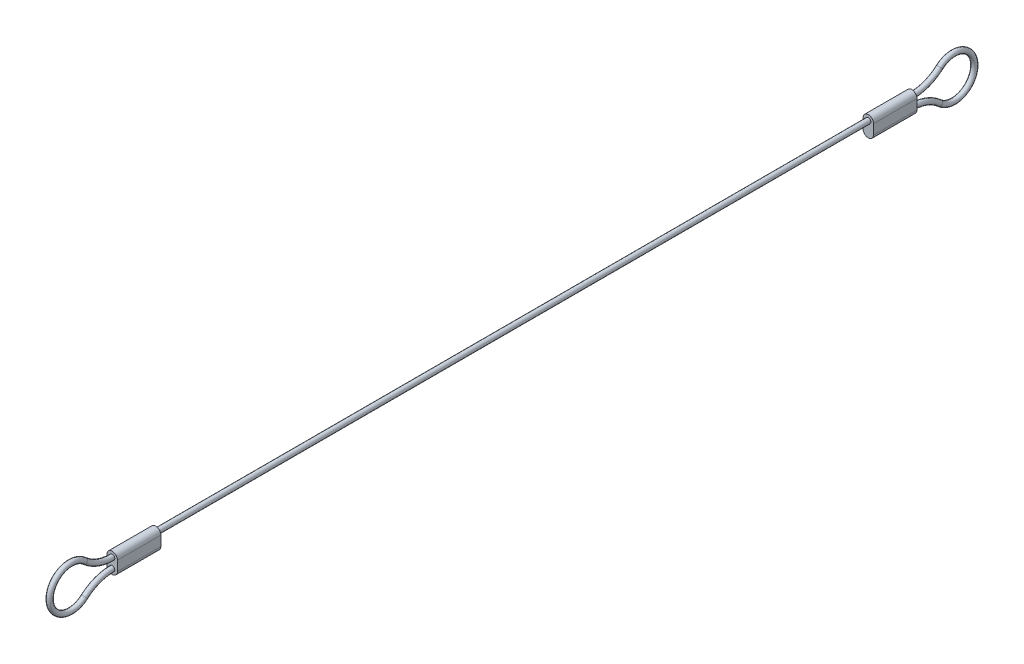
ISO-10303-21;
HEADER;
FILE_DESCRIPTION(('STEP AP214'),'2;1');
FILE_NAME('part.step','',(''),(''),'','','');
FILE_SCHEMA(('AUTOMOTIVE_DESIGN { 1 0 10303 214 1 1 1 1 }'));
ENDSEC;
DATA;
#1=APPLICATION_CONTEXT('core data for automotive mechanical design processes');
#2=APPLICATION_PROTOCOL_DEFINITION('international standard','automotive_design',2000,#1);
#3=PRODUCT_CONTEXT('',#1,'mechanical');
#4=PRODUCT('Part','Part','',(#3));
#5=PRODUCT_RELATED_PRODUCT_CATEGORY('part','',(#4));
#6=PRODUCT_DEFINITION_FORMATION('','',#4);
#7=PRODUCT_DEFINITION_CONTEXT('part definition',#1,'design');
#8=PRODUCT_DEFINITION('design','',#6,#7);
#9=PRODUCT_DEFINITION_SHAPE('','',#8);
#10=(LENGTH_UNIT() NAMED_UNIT(*) SI_UNIT(.MILLI.,.METRE.));
#11=(NAMED_UNIT(*) PLANE_ANGLE_UNIT() SI_UNIT($,.RADIAN.));
#12=(NAMED_UNIT(*) SI_UNIT($,.STERADIAN.) SOLID_ANGLE_UNIT());
#13=UNCERTAINTY_MEASURE_WITH_UNIT(LENGTH_MEASURE(1.E-05),#10,'distance_accuracy_value','');
#14=(GEOMETRIC_REPRESENTATION_CONTEXT(3) GLOBAL_UNCERTAINTY_ASSIGNED_CONTEXT((#13)) GLOBAL_UNIT_ASSIGNED_CONTEXT((#10,
#11,#12)) REPRESENTATION_CONTEXT('',''));
#15=CARTESIAN_POINT('',(0.,0.,0.));
#16=DIRECTION('',(0.,0.,1.));
#17=DIRECTION('',(1.,0.,0.));
#18=AXIS2_PLACEMENT_3D('',#15,#16,#17);
#19=CARTESIAN_POINT('',(0.,0.,-92.));
#20=DIRECTION('',(0.,0.,1.));
#21=DIRECTION('',(1.,0.,0.));
#22=AXIS2_PLACEMENT_3D('',#19,#20,#21);
#23=CYLINDRICAL_SURFACE('',#22,0.595);
#24=CARTESIAN_POINT('',(0.,0.,-82.));
#25=DIRECTION('',(0.,0.,1.));
#26=DIRECTION('',(0.,-1.,0.));
#27=AXIS2_PLACEMENT_3D('',#24,#25,#26);
#28=CIRCLE('',#27,0.595);
#29=CARTESIAN_POINT('',(0.,-0.595,-82.));
#30=VERTEX_POINT('',#29);
#31=EDGE_CURVE('E11',#30,#30,#28,.F.);
#32=ORIENTED_EDGE('',*,*,#31,.F.);
#33=EDGE_LOOP('',(#32));
#34=FACE_BOUND('',#33,.T.);
#35=CARTESIAN_POINT('',(0.,0.,82.));
#36=DIRECTION('',(0.,0.,-1.));
#37=DIRECTION('',(0.,1.,0.));
#38=AXIS2_PLACEMENT_3D('',#35,#36,#37);
#39=CIRCLE('',#38,0.595);
#40=CARTESIAN_POINT('',(0.,0.595,82.));
#41=VERTEX_POINT('',#40);
#42=EDGE_CURVE('E51',#41,#41,#39,.F.);
#43=ORIENTED_EDGE('',*,*,#42,.F.);
#44=EDGE_LOOP('',(#43));
#45=FACE_BOUND('',#44,.T.);
#46=ADVANCED_FACE('F41',(#34,#45),#23,.T.);
#47=CARTESIAN_POINT('',(0.,1.32995466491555E-13,92.));
#48=DIRECTION('',(0.,0.,-1.));
#49=DIRECTION('',(0.,1.,0.));
#50=AXIS2_PLACEMENT_3D('',#47,#48,#49);
#51=PLANE('',#50);
#52=CARTESIAN_POINT('',(0.,1.32995466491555E-13,92.));
#53=DIRECTION('',(0.,0.,-1.));
#54=DIRECTION('',(0.,1.,0.));
#55=AXIS2_PLACEMENT_3D('',#52,#53,#54);
#56=CIRCLE('',#55,1.2);
#57=CARTESIAN_POINT('',(-1.2,1.33142424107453E-13,92.));
#58=VERTEX_POINT('',#57);
#59=CARTESIAN_POINT('',(1.2,1.32848508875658E-13,92.));
#60=VERTEX_POINT('',#59);
#61=EDGE_CURVE('E185',#58,#60,#56,.T.);
#62=ORIENTED_EDGE('',*,*,#61,.F.);
#63=DIRECTION('',(0.,1.,0.));
#64=VECTOR('',#63,1.);
#65=CARTESIAN_POINT('',(-1.2,1.33142424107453E-13,92.));
#66=LINE('',#65,#64);
#67=CARTESIAN_POINT('',(-1.2,-2.26625258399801,92.));
#68=VERTEX_POINT('',#67);
#69=EDGE_CURVE('E83',#68,#58,#66,.T.);
#70=ORIENTED_EDGE('',*,*,#69,.F.);
#71=CARTESIAN_POINT('',(0.,-2.26625258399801,92.));
#72=DIRECTION('',(0.,0.,-1.));
#73=DIRECTION('',(0.,1.,0.));
#74=AXIS2_PLACEMENT_3D('',#71,#72,#73);
#75=CIRCLE('',#74,1.2);
#76=CARTESIAN_POINT('',(1.2,-2.26625258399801,92.));
#77=VERTEX_POINT('',#76);
#78=EDGE_CURVE('E77',#77,#68,#75,.T.);
#79=ORIENTED_EDGE('',*,*,#78,.F.);
#80=DIRECTION('',(0.,-1.,0.));
#81=VECTOR('',#80,1.);
#82=CARTESIAN_POINT('',(1.2,1.32848508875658E-13,92.));
#83=LINE('',#82,#81);
#84=EDGE_CURVE('E189',#60,#77,#83,.T.);
#85=ORIENTED_EDGE('',*,*,#84,.F.);
#86=EDGE_LOOP('',(#62,#70,#79,#85));
#87=FACE_BOUND('',#86,.T.);
#88=CARTESIAN_POINT('',(0.,0.,92.));
#89=DIRECTION('',(0.,0.,-1.));
#90=DIRECTION('',(0.,1.,0.));
#91=AXIS2_PLACEMENT_3D('',#88,#89,#90);
#92=CIRCLE('',#91,0.595);
#93=CARTESIAN_POINT('',(0.,-0.595000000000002,92.));
#94=VERTEX_POINT('',#93);
#95=EDGE_CURVE('E207',#94,#94,#92,.F.);
#96=ORIENTED_EDGE('',*,*,#95,.F.);
#97=EDGE_LOOP('',(#96));
#98=FACE_BOUND('',#97,.T.);
#99=CARTESIAN_POINT('',(0.,-2.26625258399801,92.));
#100=DIRECTION('',(0.,0.,-1.));
#101=DIRECTION('',(1.,0.,0.));
#102=AXIS2_PLACEMENT_3D('',#99,#100,#101);
#103=CIRCLE('',#102,0.595);
#104=CARTESIAN_POINT('',(0.,-1.67125258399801,92.));
#105=VERTEX_POINT('',#104);
#106=EDGE_CURVE('E233',#105,#105,#103,.T.);
#107=ORIENTED_EDGE('',*,*,#106,.T.);
#108=EDGE_LOOP('',(#107));
#109=FACE_BOUND('',#108,.T.);
#110=ADVANCED_FACE('F243',(#87,#98,#109),#51,.F.);
#111=CARTESIAN_POINT('',(0.,1.18539437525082E-13,82.));
#112=DIRECTION('',(0.,0.,1.));
#113=DIRECTION('',(0.,-1.,0.));
#114=AXIS2_PLACEMENT_3D('',#111,#112,#113);
#115=CYLINDRICAL_SURFACE('',#114,1.2);
#116=ORIENTED_EDGE('',*,*,#61,.T.);
#117=DIRECTION('',(0.,0.,1.));
#118=VECTOR('',#117,1.);
#119=CARTESIAN_POINT('',(1.2,1.18392479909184E-13,82.));
#120=LINE('',#119,#118);
#121=CARTESIAN_POINT('',(1.2,1.18392479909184E-13,82.));
#122=VERTEX_POINT('',#121);
#123=EDGE_CURVE('E204',#122,#60,#120,.T.);
#124=ORIENTED_EDGE('',*,*,#123,.F.);
#125=CARTESIAN_POINT('',(0.,1.18539437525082E-13,82.));
#126=DIRECTION('',(0.,0.,-1.));
#127=DIRECTION('',(0.,1.,0.));
#128=AXIS2_PLACEMENT_3D('',#125,#126,#127);
#129=CIRCLE('',#128,1.2);
#130=CARTESIAN_POINT('',(-1.2,1.1868639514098E-13,82.));
#131=VERTEX_POINT('',#130);
#132=EDGE_CURVE('E175',#131,#122,#129,.T.);
#133=ORIENTED_EDGE('',*,*,#132,.F.);
#134=DIRECTION('',(0.,0.,1.));
#135=VECTOR('',#134,1.);
#136=CARTESIAN_POINT('',(-1.2,1.1868639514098E-13,82.));
#137=LINE('',#136,#135);
#138=EDGE_CURVE('E184',#131,#58,#137,.T.);
#139=ORIENTED_EDGE('',*,*,#138,.T.);
#140=EDGE_LOOP('',(#116,#124,#133,#139));
#141=FACE_BOUND('',#140,.T.);
#142=ADVANCED_FACE('F249',(#141),#115,.T.);
#143=CARTESIAN_POINT('',(1.2,1.18392479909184E-13,82.));
#144=DIRECTION('',(-1.,0.,0.));
#145=DIRECTION('',(0.,0.,1.));
#146=AXIS2_PLACEMENT_3D('',#143,#144,#145);
#147=PLANE('',#146);
#148=ORIENTED_EDGE('',*,*,#84,.T.);
#149=DIRECTION('',(0.,0.,1.));
#150=VECTOR('',#149,1.);
#151=CARTESIAN_POINT('',(1.2,-2.26625258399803,82.));
#152=LINE('',#151,#150);
#153=CARTESIAN_POINT('',(1.2,-2.26625258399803,82.));
#154=VERTEX_POINT('',#153);
#155=EDGE_CURVE('E201',#154,#77,#152,.T.);
#156=ORIENTED_EDGE('',*,*,#155,.F.);
#157=DIRECTION('',(0.,-1.,0.));
#158=VECTOR('',#157,1.);
#159=CARTESIAN_POINT('',(1.2,1.18392479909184E-13,82.));
#160=LINE('',#159,#158);
#161=EDGE_CURVE('E91',#122,#154,#160,.T.);
#162=ORIENTED_EDGE('',*,*,#161,.F.);
#163=ORIENTED_EDGE('',*,*,#123,.T.);
#164=EDGE_LOOP('',(#148,#156,#162,#163));
#165=FACE_BOUND('',#164,.T.);
#166=ADVANCED_FACE('F291',(#165),#147,.F.);
#167=CARTESIAN_POINT('',(0.,-2.26625258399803,82.));
#168=DIRECTION('',(0.,0.,1.));
#169=DIRECTION('',(0.,-1.,0.));
#170=AXIS2_PLACEMENT_3D('',#167,#168,#169);
#171=CYLINDRICAL_SURFACE('',#170,1.2);
#172=ORIENTED_EDGE('',*,*,#78,.T.);
#173=DIRECTION('',(0.,0.,1.));
#174=VECTOR('',#173,1.);
#175=CARTESIAN_POINT('',(-1.2,-2.26625258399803,82.));
#176=LINE('',#175,#174);
#177=CARTESIAN_POINT('',(-1.2,-2.26625258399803,82.));
#178=VERTEX_POINT('',#177);
#179=EDGE_CURVE('E198',#178,#68,#176,.T.);
#180=ORIENTED_EDGE('',*,*,#179,.F.);
#181=CARTESIAN_POINT('',(0.,-2.26625258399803,82.));
#182=DIRECTION('',(0.,0.,-1.));
#183=DIRECTION('',(0.,1.,0.));
#184=AXIS2_PLACEMENT_3D('',#181,#182,#183);
#185=CIRCLE('',#184,1.2);
#186=EDGE_CURVE('E179',#154,#178,#185,.T.);
#187=ORIENTED_EDGE('',*,*,#186,.F.);
#188=ORIENTED_EDGE('',*,*,#155,.T.);
#189=EDGE_LOOP('',(#172,#180,#187,#188));
#190=FACE_BOUND('',#189,.T.);
#191=ADVANCED_FACE('F284',(#190),#171,.T.);
#192=CARTESIAN_POINT('',(-1.2,1.1868639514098E-13,82.));
#193=DIRECTION('',(1.,0.,0.));
#194=DIRECTION('',(0.,1.,0.));
#195=AXIS2_PLACEMENT_3D('',#192,#193,#194);
#196=PLANE('',#195);
#197=ORIENTED_EDGE('',*,*,#69,.T.);
#198=ORIENTED_EDGE('',*,*,#138,.F.);
#199=DIRECTION('',(0.,1.,0.));
#200=VECTOR('',#199,1.);
#201=CARTESIAN_POINT('',(-1.2,1.1868639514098E-13,82.));
#202=LINE('',#201,#200);
#203=EDGE_CURVE('E59',#178,#131,#202,.T.);
#204=ORIENTED_EDGE('',*,*,#203,.F.);
#205=ORIENTED_EDGE('',*,*,#179,.T.);
#206=EDGE_LOOP('',(#197,#198,#204,#205));
#207=FACE_BOUND('',#206,.T.);
#208=ADVANCED_FACE('F279',(#207),#196,.F.);
#209=CARTESIAN_POINT('',(0.,1.18539437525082E-13,82.));
#210=DIRECTION('',(0.,0.,-1.));
#211=DIRECTION('',(0.,1.,0.));
#212=AXIS2_PLACEMENT_3D('',#209,#210,#211);
#213=PLANE('',#212);
#214=ORIENTED_EDGE('',*,*,#42,.T.);
#215=EDGE_LOOP('',(#214));
#216=FACE_BOUND('',#215,.T.);
#217=ORIENTED_EDGE('',*,*,#132,.T.);
#218=ORIENTED_EDGE('',*,*,#161,.T.);
#219=ORIENTED_EDGE('',*,*,#186,.T.);
#220=ORIENTED_EDGE('',*,*,#203,.T.);
#221=EDGE_LOOP('',(#217,#218,#219,#220));
#222=FACE_BOUND('',#221,.T.);
#223=ADVANCED_FACE('F240',(#216,#222),#213,.T.);
#224=CARTESIAN_POINT('',(0.,-11.866252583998,92.));
#225=DIRECTION('',(-1.,0.,0.));
#226=DIRECTION('',(0.,0.,1.));
#227=AXIS2_PLACEMENT_3D('',#224,#225,#226);
#228=TOROIDAL_SURFACE('',#227,9.59999999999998,0.595);
#229=CARTESIAN_POINT('',(0.,-4.71083505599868,98.4));
#230=DIRECTION('',(0.,0.666666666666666,-0.74535599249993));
#231=DIRECTION('',(1.,0.,0.));
#232=AXIS2_PLACEMENT_3D('',#229,#230,#231);
#233=CIRCLE('',#232,0.595);
#234=CARTESIAN_POINT('',(0.,-4.26734824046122,98.7966666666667));
#235=VERTEX_POINT('',#234);
#236=EDGE_CURVE('E229',#235,#235,#233,.T.);
#237=CARTESIAN_POINT('',(0.,-11.866252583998,92.));
#238=DIRECTION('',(-1.,0.,0.));
#239=DIRECTION('',(0.,0.,1.));
#240=AXIS2_PLACEMENT_3D('',#237,#238,#239);
#241=CIRCLE('',#240,10.195);
#242=EDGE_CURVE('',#235,#105,#241,.T.);
#243=ORIENTED_EDGE('',*,*,#236,.T.);
#244=ORIENTED_EDGE('',*,*,#106,.F.);
#245=ORIENTED_EDGE('',*,*,#242,.T.);
#246=ORIENTED_EDGE('',*,*,#242,.F.);
#247=EDGE_LOOP('',(#243,#245,#244,#246));
#248=FACE_BOUND('',#247,.T.);
#249=ADVANCED_FACE('F43',(#248),#228,.T.);
#250=CARTESIAN_POINT('',(0.,-1.133126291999,101.6));
#251=DIRECTION('',(1.,0.,0.));
#252=DIRECTION('',(0.,0.,-1.));
#253=AXIS2_PLACEMENT_3D('',#250,#251,#252);
#254=TOROIDAL_SURFACE('',#253,4.80000000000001,0.595);
#255=ORIENTED_EDGE('',*,*,#236,.F.);
#256=EDGE_LOOP('',(#255));
#257=FACE_BOUND('',#256,.T.);
#258=CARTESIAN_POINT('',(0.,2.44458247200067,98.4));
#259=DIRECTION('',(0.,0.666666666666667,0.74535599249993));
#260=DIRECTION('',(1.,0.,0.));
#261=AXIS2_PLACEMENT_3D('',#258,#259,#260);
#262=CIRCLE('',#261,0.595);
#263=CARTESIAN_POINT('',(0.,2.00109565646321,98.7966666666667));
#264=VERTEX_POINT('',#263);
#265=EDGE_CURVE('E225',#264,#264,#262,.T.);
#266=ORIENTED_EDGE('',*,*,#265,.T.);
#267=EDGE_LOOP('',(#266));
#268=FACE_BOUND('',#267,.T.);
#269=ADVANCED_FACE('F259',(#257,#268),#254,.T.);
#270=CARTESIAN_POINT('',(0.,9.59999999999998,92.));
#271=DIRECTION('',(-1.,0.,0.));
#272=DIRECTION('',(0.,0.,1.));
#273=AXIS2_PLACEMENT_3D('',#270,#271,#272);
#274=TOROIDAL_SURFACE('',#273,9.59999999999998,0.595);
#275=CARTESIAN_POINT('',(0.,9.59999999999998,92.));
#276=DIRECTION('',(-1.,0.,0.));
#277=DIRECTION('',(0.,0.,1.));
#278=AXIS2_PLACEMENT_3D('',#275,#276,#277);
#279=CIRCLE('',#278,10.195);
#280=EDGE_CURVE('',#94,#264,#279,.T.);
#281=ORIENTED_EDGE('',*,*,#95,.T.);
#282=ORIENTED_EDGE('',*,*,#265,.F.);
#283=ORIENTED_EDGE('',*,*,#280,.T.);
#284=ORIENTED_EDGE('',*,*,#280,.F.);
#285=EDGE_LOOP('',(#281,#283,#282,#284));
#286=FACE_BOUND('',#285,.T.);
#287=ADVANCED_FACE('F257',(#286),#274,.T.);
#288=CARTESIAN_POINT('',(0.,1.18539437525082E-13,-82.));
#289=DIRECTION('',(0.,0.,-1.));
#290=DIRECTION('',(0.,1.,0.));
#291=AXIS2_PLACEMENT_3D('',#288,#289,#290);
#292=CYLINDRICAL_SURFACE('',#291,1.2);
#293=CARTESIAN_POINT('',(0.,1.32995466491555E-13,-92.));
#294=DIRECTION('',(0.,0.,-1.));
#295=DIRECTION('',(0.,1.,0.));
#296=AXIS2_PLACEMENT_3D('',#293,#294,#295);
#297=CIRCLE('',#296,1.2);
#298=CARTESIAN_POINT('',(-1.2,1.33142424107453E-13,-92.));
#299=VERTEX_POINT('',#298);
#300=CARTESIAN_POINT('',(1.2,1.32848508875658E-13,-92.));
#301=VERTEX_POINT('',#300);
#302=EDGE_CURVE('E124',#299,#301,#297,.T.);
#303=ORIENTED_EDGE('',*,*,#302,.F.);
#304=DIRECTION('',(0.,0.,-1.));
#305=VECTOR('',#304,1.);
#306=CARTESIAN_POINT('',(-1.2,1.1868639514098E-13,-82.));
#307=LINE('',#306,#305);
#308=CARTESIAN_POINT('',(-1.2,1.1868639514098E-13,-82.));
#309=VERTEX_POINT('',#308);
#310=EDGE_CURVE('E118',#309,#299,#307,.T.);
#311=ORIENTED_EDGE('',*,*,#310,.F.);
#312=CARTESIAN_POINT('',(0.,1.18539437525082E-13,-82.));
#313=DIRECTION('',(0.,0.,-1.));
#314=DIRECTION('',(0.,1.,0.));
#315=AXIS2_PLACEMENT_3D('',#312,#313,#314);
#316=CIRCLE('',#315,1.2);
#317=CARTESIAN_POINT('',(1.2,1.18392479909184E-13,-82.));
#318=VERTEX_POINT('',#317);
#319=EDGE_CURVE('E121',#309,#318,#316,.T.);
#320=ORIENTED_EDGE('',*,*,#319,.T.);
#321=DIRECTION('',(0.,0.,-1.));
#322=VECTOR('',#321,1.);
#323=CARTESIAN_POINT('',(1.2,1.18392479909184E-13,-82.));
#324=LINE('',#323,#322);
#325=EDGE_CURVE('E155',#318,#301,#324,.T.);
#326=ORIENTED_EDGE('',*,*,#325,.T.);
#327=EDGE_LOOP('',(#303,#311,#320,#326));
#328=FACE_BOUND('',#327,.T.);
#329=ADVANCED_FACE('F120',(#328),#292,.T.);
#330=CARTESIAN_POINT('',(-1.2,1.1868639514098E-13,-82.));
#331=DIRECTION('',(-1.,0.,0.));
#332=DIRECTION('',(0.,-1.,0.));
#333=AXIS2_PLACEMENT_3D('',#330,#331,#332);
#334=PLANE('',#333);
#335=DIRECTION('',(0.,1.,0.));
#336=VECTOR('',#335,1.);
#337=CARTESIAN_POINT('',(-1.2,1.33142424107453E-13,-92.));
#338=LINE('',#337,#336);
#339=CARTESIAN_POINT('',(-1.2,-2.26625258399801,-92.));
#340=VERTEX_POINT('',#339);
#341=EDGE_CURVE('E158',#340,#299,#338,.T.);
#342=ORIENTED_EDGE('',*,*,#341,.F.);
#343=DIRECTION('',(0.,0.,-1.));
#344=VECTOR('',#343,1.);
#345=CARTESIAN_POINT('',(-1.2,-2.26625258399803,-82.));
#346=LINE('',#345,#344);
#347=CARTESIAN_POINT('',(-1.2,-2.26625258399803,-82.));
#348=VERTEX_POINT('',#347);
#349=EDGE_CURVE('E131',#348,#340,#346,.T.);
#350=ORIENTED_EDGE('',*,*,#349,.F.);
#351=DIRECTION('',(0.,1.,0.));
#352=VECTOR('',#351,1.);
#353=CARTESIAN_POINT('',(-1.2,1.1868639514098E-13,-82.));
#354=LINE('',#353,#352);
#355=EDGE_CURVE('E137',#348,#309,#354,.T.);
#356=ORIENTED_EDGE('',*,*,#355,.T.);
#357=ORIENTED_EDGE('',*,*,#310,.T.);
#358=EDGE_LOOP('',(#342,#350,#356,#357));
#359=FACE_BOUND('',#358,.T.);
#360=ADVANCED_FACE('F144',(#359),#334,.T.);
#361=CARTESIAN_POINT('',(0.,-2.26625258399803,-82.));
#362=DIRECTION('',(0.,0.,-1.));
#363=DIRECTION('',(0.,1.,0.));
#364=AXIS2_PLACEMENT_3D('',#361,#362,#363);
#365=CYLINDRICAL_SURFACE('',#364,1.2);
#366=CARTESIAN_POINT('',(0.,-2.26625258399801,-92.));
#367=DIRECTION('',(0.,0.,-1.));
#368=DIRECTION('',(0.,1.,0.));
#369=AXIS2_PLACEMENT_3D('',#366,#367,#368);
#370=CIRCLE('',#369,1.2);
#371=CARTESIAN_POINT('',(1.2,-2.26625258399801,-92.));
#372=VERTEX_POINT('',#371);
#373=EDGE_CURVE('E161',#372,#340,#370,.T.);
#374=ORIENTED_EDGE('',*,*,#373,.F.);
#375=DIRECTION('',(0.,0.,-1.));
#376=VECTOR('',#375,1.);
#377=CARTESIAN_POINT('',(1.2,-2.26625258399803,-82.));
#378=LINE('',#377,#376);
#379=CARTESIAN_POINT('',(1.2,-2.26625258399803,-82.));
#380=VERTEX_POINT('',#379);
#381=EDGE_CURVE('E170',#380,#372,#378,.T.);
#382=ORIENTED_EDGE('',*,*,#381,.F.);
#383=CARTESIAN_POINT('',(0.,-2.26625258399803,-82.));
#384=DIRECTION('',(0.,0.,-1.));
#385=DIRECTION('',(0.,1.,0.));
#386=AXIS2_PLACEMENT_3D('',#383,#384,#385);
#387=CIRCLE('',#386,1.2);
#388=EDGE_CURVE('E146',#380,#348,#387,.T.);
#389=ORIENTED_EDGE('',*,*,#388,.T.);
#390=ORIENTED_EDGE('',*,*,#349,.T.);
#391=EDGE_LOOP('',(#374,#382,#389,#390));
#392=FACE_BOUND('',#391,.T.);
#393=ADVANCED_FACE('F324',(#392),#365,.T.);
#394=CARTESIAN_POINT('',(1.2,1.18392479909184E-13,-82.));
#395=DIRECTION('',(1.,0.,0.));
#396=DIRECTION('',(0.,0.,-1.));
#397=AXIS2_PLACEMENT_3D('',#394,#395,#396);
#398=PLANE('',#397);
#399=DIRECTION('',(0.,-1.,0.));
#400=VECTOR('',#399,1.);
#401=CARTESIAN_POINT('',(1.2,1.32848508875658E-13,-92.));
#402=LINE('',#401,#400);
#403=EDGE_CURVE('E142',#301,#372,#402,.T.);
#404=ORIENTED_EDGE('',*,*,#403,.F.);
#405=ORIENTED_EDGE('',*,*,#325,.F.);
#406=DIRECTION('',(0.,-1.,0.));
#407=VECTOR('',#406,1.);
#408=CARTESIAN_POINT('',(1.2,1.18392479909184E-13,-82.));
#409=LINE('',#408,#407);
#410=EDGE_CURVE('E140',#318,#380,#409,.T.);
#411=ORIENTED_EDGE('',*,*,#410,.T.);
#412=ORIENTED_EDGE('',*,*,#381,.T.);
#413=EDGE_LOOP('',(#404,#405,#411,#412));
#414=FACE_BOUND('',#413,.T.);
#415=ADVANCED_FACE('F321',(#414),#398,.T.);
#416=CARTESIAN_POINT('',(0.,1.18539437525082E-13,-82.));
#417=DIRECTION('',(0.,0.,1.));
#418=DIRECTION('',(0.,1.,0.));
#419=AXIS2_PLACEMENT_3D('',#416,#417,#418);
#420=PLANE('',#419);
#421=ORIENTED_EDGE('',*,*,#31,.T.);
#422=EDGE_LOOP('',(#421));
#423=FACE_BOUND('',#422,.T.);
#424=ORIENTED_EDGE('',*,*,#319,.F.);
#425=ORIENTED_EDGE('',*,*,#355,.F.);
#426=ORIENTED_EDGE('',*,*,#388,.F.);
#427=ORIENTED_EDGE('',*,*,#410,.F.);
#428=EDGE_LOOP('',(#424,#425,#426,#427));
#429=FACE_BOUND('',#428,.T.);
#430=ADVANCED_FACE('F135',(#423,#429),#420,.T.);
#431=CARTESIAN_POINT('',(0.,1.32995466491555E-13,-92.));
#432=DIRECTION('',(0.,0.,1.));
#433=DIRECTION('',(0.,1.,0.));
#434=AXIS2_PLACEMENT_3D('',#431,#432,#433);
#435=PLANE('',#434);
#436=CARTESIAN_POINT('',(0.,-2.26625258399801,-92.));
#437=DIRECTION('',(0.,0.,-1.));
#438=DIRECTION('',(1.,0.,0.));
#439=AXIS2_PLACEMENT_3D('',#436,#437,#438);
#440=CIRCLE('',#439,0.595);
#441=CARTESIAN_POINT('',(0.,-1.67125258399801,-92.));
#442=VERTEX_POINT('',#441);
#443=EDGE_CURVE('E130',#442,#442,#440,.T.);
#444=ORIENTED_EDGE('',*,*,#443,.F.);
#445=EDGE_LOOP('',(#444));
#446=FACE_BOUND('',#445,.T.);
#447=CARTESIAN_POINT('',(0.,0.,-92.));
#448=DIRECTION('',(0.,0.,1.));
#449=DIRECTION('',(1.,0.,0.));
#450=AXIS2_PLACEMENT_3D('',#447,#448,#449);
#451=CIRCLE('',#450,0.595);
#452=CARTESIAN_POINT('',(0.,-0.595,-92.));
#453=VERTEX_POINT('',#452);
#454=EDGE_CURVE('E221',#453,#453,#451,.T.);
#455=ORIENTED_EDGE('',*,*,#454,.T.);
#456=EDGE_LOOP('',(#455));
#457=FACE_BOUND('',#456,.T.);
#458=ORIENTED_EDGE('',*,*,#302,.T.);
#459=ORIENTED_EDGE('',*,*,#403,.T.);
#460=ORIENTED_EDGE('',*,*,#373,.T.);
#461=ORIENTED_EDGE('',*,*,#341,.T.);
#462=EDGE_LOOP('',(#458,#459,#460,#461));
#463=FACE_BOUND('',#462,.T.);
#464=ADVANCED_FACE('F300',(#446,#457,#463),#435,.F.);
#465=CARTESIAN_POINT('',(0.,-11.866252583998,-92.));
#466=DIRECTION('',(-1.,0.,0.));
#467=DIRECTION('',(0.,0.,1.));
#468=AXIS2_PLACEMENT_3D('',#465,#466,#467);
#469=TOROIDAL_SURFACE('',#468,9.59999999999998,0.595);
#470=CARTESIAN_POINT('',(0.,-4.71083505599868,-98.4));
#471=DIRECTION('',(0.,-0.666666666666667,-0.74535599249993));
#472=DIRECTION('',(1.,0.,0.));
#473=AXIS2_PLACEMENT_3D('',#470,#471,#472);
#474=CIRCLE('',#473,0.595);
#475=CARTESIAN_POINT('',(0.,-4.26734824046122,-98.7966666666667));
#476=VERTEX_POINT('',#475);
#477=EDGE_CURVE('E211',#476,#476,#474,.T.);
#478=CARTESIAN_POINT('',(0.,-11.866252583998,-92.));
#479=DIRECTION('',(-1.,0.,0.));
#480=DIRECTION('',(0.,0.,1.));
#481=AXIS2_PLACEMENT_3D('',#478,#479,#480);
#482=CIRCLE('',#481,10.195);
#483=EDGE_CURVE('',#442,#476,#482,.T.);
#484=ORIENTED_EDGE('',*,*,#443,.T.);
#485=ORIENTED_EDGE('',*,*,#477,.F.);
#486=ORIENTED_EDGE('',*,*,#483,.T.);
#487=ORIENTED_EDGE('',*,*,#483,.F.);
#488=EDGE_LOOP('',(#484,#486,#485,#487));
#489=FACE_BOUND('',#488,.T.);
#490=ADVANCED_FACE('F297',(#489),#469,.T.);
#491=CARTESIAN_POINT('',(0.,-1.133126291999,-101.6));
#492=DIRECTION('',(1.,0.,0.));
#493=DIRECTION('',(0.,0.,-1.));
#494=AXIS2_PLACEMENT_3D('',#491,#492,#493);
#495=TOROIDAL_SURFACE('',#494,4.80000000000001,0.595);
#496=CARTESIAN_POINT('',(0.,2.44458247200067,-98.4));
#497=DIRECTION('',(0.,-0.666666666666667,0.74535599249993));
#498=DIRECTION('',(1.,0.,0.));
#499=AXIS2_PLACEMENT_3D('',#496,#497,#498);
#500=CIRCLE('',#499,0.595);
#501=CARTESIAN_POINT('',(0.,2.00109565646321,-98.7966666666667));
#502=VERTEX_POINT('',#501);
#503=EDGE_CURVE('E218',#502,#502,#500,.T.);
#504=ORIENTED_EDGE('',*,*,#503,.F.);
#505=EDGE_LOOP('',(#504));
#506=FACE_BOUND('',#505,.T.);
#507=ORIENTED_EDGE('',*,*,#477,.T.);
#508=EDGE_LOOP('',(#507));
#509=FACE_BOUND('',#508,.T.);
#510=ADVANCED_FACE('F299',(#506,#509),#495,.T.);
#511=CARTESIAN_POINT('',(0.,9.59999999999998,-92.));
#512=DIRECTION('',(-1.,0.,0.));
#513=DIRECTION('',(0.,0.,1.));
#514=AXIS2_PLACEMENT_3D('',#511,#512,#513);
#515=TOROIDAL_SURFACE('',#514,9.59999999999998,0.595);
#516=CARTESIAN_POINT('',(0.,9.59999999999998,-92.));
#517=DIRECTION('',(-1.,0.,0.));
#518=DIRECTION('',(0.,0.,1.));
#519=AXIS2_PLACEMENT_3D('',#516,#517,#518);
#520=CIRCLE('',#519,10.195);
#521=EDGE_CURVE('',#502,#453,#520,.T.);
#522=ORIENTED_EDGE('',*,*,#503,.T.);
#523=ORIENTED_EDGE('',*,*,#454,.F.);
#524=ORIENTED_EDGE('',*,*,#521,.T.);
#525=ORIENTED_EDGE('',*,*,#521,.F.);
#526=EDGE_LOOP('',(#522,#524,#523,#525));
#527=FACE_BOUND('',#526,.T.);
#528=ADVANCED_FACE('F255',(#527),#515,.T.);
#529=CLOSED_SHELL('',(#46,#110,#142,#166,#191,#208,#223,#249,#269,#287,#329,#360,#393,#415,#430,
#464,#490,#510,#528));
#530=MANIFOLD_SOLID_BREP('B2',#529);
#531=ADVANCED_BREP_SHAPE_REPRESENTATION('',(#18,#530),#14);
#532=SHAPE_DEFINITION_REPRESENTATION(#9,#531);
ENDSEC;
END-ISO-10303-21;
